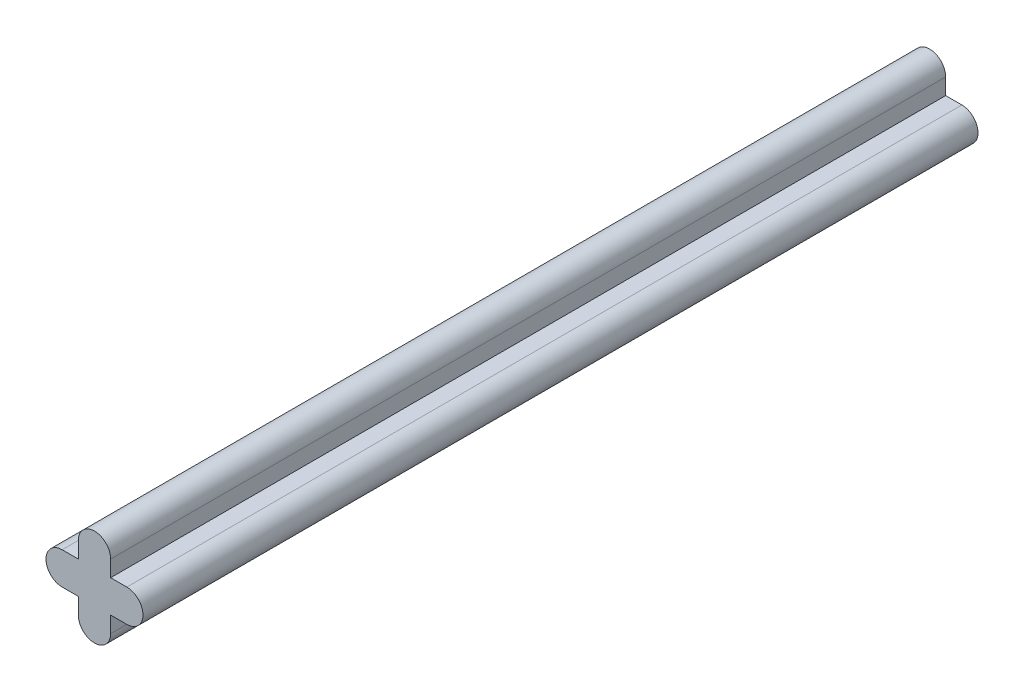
ISO-10303-21;
HEADER;
FILE_DESCRIPTION(('STEP AP214'),'2;1');
FILE_NAME('part.step','',(''),(''),'','','');
FILE_SCHEMA(('AUTOMOTIVE_DESIGN { 1 0 10303 214 1 1 1 1 }'));
ENDSEC;
DATA;
#1=APPLICATION_CONTEXT('core data for automotive mechanical design processes');
#2=APPLICATION_PROTOCOL_DEFINITION('international standard','automotive_design',2000,#1);
#3=PRODUCT_CONTEXT('',#1,'mechanical');
#4=PRODUCT('Part','Part','',(#3));
#5=PRODUCT_RELATED_PRODUCT_CATEGORY('part','',(#4));
#6=PRODUCT_DEFINITION_FORMATION('','',#4);
#7=PRODUCT_DEFINITION_CONTEXT('part definition',#1,'design');
#8=PRODUCT_DEFINITION('design','',#6,#7);
#9=PRODUCT_DEFINITION_SHAPE('','',#8);
#10=(LENGTH_UNIT() NAMED_UNIT(*) SI_UNIT(.MILLI.,.METRE.));
#11=(NAMED_UNIT(*) PLANE_ANGLE_UNIT() SI_UNIT($,.RADIAN.));
#12=(NAMED_UNIT(*) SI_UNIT($,.STERADIAN.) SOLID_ANGLE_UNIT());
#13=UNCERTAINTY_MEASURE_WITH_UNIT(LENGTH_MEASURE(1.E-05),#10,'distance_accuracy_value','');
#14=(GEOMETRIC_REPRESENTATION_CONTEXT(3) GLOBAL_UNCERTAINTY_ASSIGNED_CONTEXT((#13)) GLOBAL_UNIT_ASSIGNED_CONTEXT((#10,
#11,#12)) REPRESENTATION_CONTEXT('',''));
#15=CARTESIAN_POINT('',(0.,0.,0.));
#16=DIRECTION('',(0.,0.,1.));
#17=DIRECTION('',(1.,0.,0.));
#18=AXIS2_PLACEMENT_3D('',#15,#16,#17);
#19=CARTESIAN_POINT('',(1.524,0.762,39.37));
#20=DIRECTION('',(0.,1.,0.));
#21=DIRECTION('',(0.,0.,1.));
#22=AXIS2_PLACEMENT_3D('',#19,#20,#21);
#23=PLANE('',#22);
#24=DIRECTION('',(1.,0.,0.));
#25=VECTOR('',#24,1.);
#26=CARTESIAN_POINT('',(1.524,0.762,0.));
#27=LINE('',#26,#25);
#28=CARTESIAN_POINT('',(0.,0.762,0.));
#29=VERTEX_POINT('',#28);
#30=CARTESIAN_POINT('',(0.762000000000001,0.762,0.));
#31=VERTEX_POINT('',#30);
#32=EDGE_CURVE('E152',#29,#31,#27,.T.);
#33=ORIENTED_EDGE('',*,*,#32,.F.);
#34=DIRECTION('',(0.,0.,-1.));
#35=VECTOR('',#34,1.);
#36=CARTESIAN_POINT('',(0.,0.762,39.37));
#37=LINE('',#36,#35);
#38=CARTESIAN_POINT('',(0.,0.762,39.37));
#39=VERTEX_POINT('',#38);
#40=EDGE_CURVE('E11',#39,#29,#37,.T.);
#41=ORIENTED_EDGE('',*,*,#40,.F.);
#42=DIRECTION('',(1.,0.,0.));
#43=VECTOR('',#42,1.);
#44=CARTESIAN_POINT('',(1.524,0.762,39.37));
#45=LINE('',#44,#43);
#46=CARTESIAN_POINT('',(0.762000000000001,0.762,39.37));
#47=VERTEX_POINT('',#46);
#48=EDGE_CURVE('E179',#39,#47,#45,.T.);
#49=ORIENTED_EDGE('',*,*,#48,.T.);
#50=DIRECTION('',(0.,0.,-1.));
#51=VECTOR('',#50,1.);
#52=CARTESIAN_POINT('',(0.762000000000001,0.762,39.37));
#53=LINE('',#52,#51);
#54=EDGE_CURVE('E96',#47,#31,#53,.T.);
#55=ORIENTED_EDGE('',*,*,#54,.T.);
#56=EDGE_LOOP('',(#33,#41,#49,#55));
#57=FACE_BOUND('',#56,.T.);
#58=ADVANCED_FACE('F34',(#57),#23,.T.);
#59=CARTESIAN_POINT('',(0.,0.,39.37));
#60=DIRECTION('',(0.,0.,-1.));
#61=DIRECTION('',(-1.,0.,0.));
#62=AXIS2_PLACEMENT_3D('',#59,#60,#61);
#63=CYLINDRICAL_SURFACE('',#62,0.762);
#64=CARTESIAN_POINT('',(0.,0.,0.));
#65=DIRECTION('',(0.,0.,1.));
#66=DIRECTION('',(1.,0.,0.));
#67=AXIS2_PLACEMENT_3D('',#64,#65,#66);
#68=CIRCLE('',#67,0.762);
#69=CARTESIAN_POINT('',(0.,-0.762,0.));
#70=VERTEX_POINT('',#69);
#71=EDGE_CURVE('E155',#29,#70,#68,.T.);
#72=ORIENTED_EDGE('',*,*,#71,.T.);
#73=DIRECTION('',(0.,0.,-1.));
#74=VECTOR('',#73,1.);
#75=CARTESIAN_POINT('',(0.,-0.762,39.37));
#76=LINE('',#75,#74);
#77=CARTESIAN_POINT('',(0.,-0.762,39.37));
#78=VERTEX_POINT('',#77);
#79=EDGE_CURVE('E42',#78,#70,#76,.T.);
#80=ORIENTED_EDGE('',*,*,#79,.F.);
#81=CARTESIAN_POINT('',(0.,0.,39.37));
#82=DIRECTION('',(0.,0.,1.));
#83=DIRECTION('',(1.,0.,0.));
#84=AXIS2_PLACEMENT_3D('',#81,#82,#83);
#85=CIRCLE('',#84,0.762);
#86=EDGE_CURVE('E243',#39,#78,#85,.T.);
#87=ORIENTED_EDGE('',*,*,#86,.F.);
#88=ORIENTED_EDGE('',*,*,#40,.T.);
#89=EDGE_LOOP('',(#72,#80,#87,#88));
#90=FACE_BOUND('',#89,.T.);
#91=ADVANCED_FACE('F246',(#90),#63,.T.);
#92=CARTESIAN_POINT('',(1.524,-0.762,39.37));
#93=DIRECTION('',(0.,1.,0.));
#94=DIRECTION('',(0.,0.,1.));
#95=AXIS2_PLACEMENT_3D('',#92,#93,#94);
#96=PLANE('',#95);
#97=DIRECTION('',(1.,0.,0.));
#98=VECTOR('',#97,1.);
#99=CARTESIAN_POINT('',(1.524,-0.762,0.));
#100=LINE('',#99,#98);
#101=CARTESIAN_POINT('',(0.762000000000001,-0.762,0.));
#102=VERTEX_POINT('',#101);
#103=EDGE_CURVE('E157',#70,#102,#100,.T.);
#104=ORIENTED_EDGE('',*,*,#103,.T.);
#105=DIRECTION('',(0.,0.,-1.));
#106=VECTOR('',#105,1.);
#107=CARTESIAN_POINT('',(0.762000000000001,-0.762,39.37));
#108=LINE('',#107,#106);
#109=CARTESIAN_POINT('',(0.762000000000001,-0.762,39.37));
#110=VERTEX_POINT('',#109);
#111=EDGE_CURVE('E195',#110,#102,#108,.T.);
#112=ORIENTED_EDGE('',*,*,#111,.F.);
#113=DIRECTION('',(1.,0.,0.));
#114=VECTOR('',#113,1.);
#115=CARTESIAN_POINT('',(1.524,-0.762,39.37));
#116=LINE('',#115,#114);
#117=EDGE_CURVE('E204',#78,#110,#116,.T.);
#118=ORIENTED_EDGE('',*,*,#117,.F.);
#119=ORIENTED_EDGE('',*,*,#79,.T.);
#120=EDGE_LOOP('',(#104,#112,#118,#119));
#121=FACE_BOUND('',#120,.T.);
#122=ADVANCED_FACE('F202',(#121),#96,.F.);
#123=CARTESIAN_POINT('',(0.762000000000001,-4.4302164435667,39.37));
#124=DIRECTION('',(1.,0.,0.));
#125=DIRECTION('',(0.,0.,-1.));
#126=AXIS2_PLACEMENT_3D('',#123,#124,#125);
#127=PLANE('',#126);
#128=DIRECTION('',(0.,-1.,0.));
#129=VECTOR('',#128,1.);
#130=CARTESIAN_POINT('',(0.762000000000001,-4.4302164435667,0.));
#131=LINE('',#130,#129);
#132=CARTESIAN_POINT('',(0.762000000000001,-1.524,0.));
#133=VERTEX_POINT('',#132);
#134=EDGE_CURVE('E159',#102,#133,#131,.T.);
#135=ORIENTED_EDGE('',*,*,#134,.T.);
#136=DIRECTION('',(0.,0.,-1.));
#137=VECTOR('',#136,1.);
#138=CARTESIAN_POINT('',(0.762000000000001,-1.524,39.37));
#139=LINE('',#138,#137);
#140=CARTESIAN_POINT('',(0.762000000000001,-1.524,39.37));
#141=VERTEX_POINT('',#140);
#142=EDGE_CURVE('E192',#141,#133,#139,.T.);
#143=ORIENTED_EDGE('',*,*,#142,.F.);
#144=DIRECTION('',(0.,-1.,0.));
#145=VECTOR('',#144,1.);
#146=CARTESIAN_POINT('',(0.762000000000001,-4.4302164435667,39.37));
#147=LINE('',#146,#145);
#148=EDGE_CURVE('E223',#110,#141,#147,.T.);
#149=ORIENTED_EDGE('',*,*,#148,.F.);
#150=ORIENTED_EDGE('',*,*,#111,.T.);
#151=EDGE_LOOP('',(#135,#143,#149,#150));
#152=FACE_BOUND('',#151,.T.);
#153=ADVANCED_FACE('F213',(#152),#127,.F.);
#154=CARTESIAN_POINT('',(1.524,-1.524,39.37));
#155=DIRECTION('',(0.,0.,-1.));
#156=DIRECTION('',(-1.,0.,0.));
#157=AXIS2_PLACEMENT_3D('',#154,#155,#156);
#158=CYLINDRICAL_SURFACE('',#157,0.761999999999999);
#159=CARTESIAN_POINT('',(1.524,-1.524,0.));
#160=DIRECTION('',(0.,0.,1.));
#161=DIRECTION('',(1.,0.,0.));
#162=AXIS2_PLACEMENT_3D('',#159,#160,#161);
#163=CIRCLE('',#162,0.761999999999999);
#164=CARTESIAN_POINT('',(2.286,-1.524,0.));
#165=VERTEX_POINT('',#164);
#166=EDGE_CURVE('E161',#133,#165,#163,.T.);
#167=ORIENTED_EDGE('',*,*,#166,.T.);
#168=DIRECTION('',(0.,0.,-1.));
#169=VECTOR('',#168,1.);
#170=CARTESIAN_POINT('',(2.286,-1.524,39.37));
#171=LINE('',#170,#169);
#172=CARTESIAN_POINT('',(2.286,-1.524,39.37));
#173=VERTEX_POINT('',#172);
#174=EDGE_CURVE('E190',#173,#165,#171,.T.);
#175=ORIENTED_EDGE('',*,*,#174,.F.);
#176=CARTESIAN_POINT('',(1.524,-1.524,39.37));
#177=DIRECTION('',(0.,0.,1.));
#178=DIRECTION('',(1.,0.,0.));
#179=AXIS2_PLACEMENT_3D('',#176,#177,#178);
#180=CIRCLE('',#179,0.761999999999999);
#181=EDGE_CURVE('E219',#141,#173,#180,.T.);
#182=ORIENTED_EDGE('',*,*,#181,.F.);
#183=ORIENTED_EDGE('',*,*,#142,.T.);
#184=EDGE_LOOP('',(#167,#175,#182,#183));
#185=FACE_BOUND('',#184,.T.);
#186=ADVANCED_FACE('F217',(#185),#158,.T.);
#187=CARTESIAN_POINT('',(2.286,-4.4302164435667,39.37));
#188=DIRECTION('',(1.,0.,0.));
#189=DIRECTION('',(0.,0.,-1.));
#190=AXIS2_PLACEMENT_3D('',#187,#188,#189);
#191=PLANE('',#190);
#192=DIRECTION('',(0.,-1.,0.));
#193=VECTOR('',#192,1.);
#194=CARTESIAN_POINT('',(2.286,-4.4302164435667,0.));
#195=LINE('',#194,#193);
#196=CARTESIAN_POINT('',(2.286,-0.762,0.));
#197=VERTEX_POINT('',#196);
#198=EDGE_CURVE('E164',#197,#165,#195,.T.);
#199=ORIENTED_EDGE('',*,*,#198,.F.);
#200=DIRECTION('',(0.,0.,-1.));
#201=VECTOR('',#200,1.);
#202=CARTESIAN_POINT('',(2.286,-0.762,39.37));
#203=LINE('',#202,#201);
#204=CARTESIAN_POINT('',(2.286,-0.762,39.37));
#205=VERTEX_POINT('',#204);
#206=EDGE_CURVE('E188',#205,#197,#203,.T.);
#207=ORIENTED_EDGE('',*,*,#206,.F.);
#208=DIRECTION('',(0.,-1.,0.));
#209=VECTOR('',#208,1.);
#210=CARTESIAN_POINT('',(2.286,-4.4302164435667,39.37));
#211=LINE('',#210,#209);
#212=EDGE_CURVE('E222',#205,#173,#211,.T.);
#213=ORIENTED_EDGE('',*,*,#212,.T.);
#214=ORIENTED_EDGE('',*,*,#174,.T.);
#215=EDGE_LOOP('',(#199,#207,#213,#214));
#216=FACE_BOUND('',#215,.T.);
#217=ADVANCED_FACE('F258',(#216),#191,.T.);
#218=CARTESIAN_POINT('',(1.524,-0.762,39.37));
#219=DIRECTION('',(0.,1.,0.));
#220=DIRECTION('',(0.,0.,1.));
#221=AXIS2_PLACEMENT_3D('',#218,#219,#220);
#222=PLANE('',#221);
#223=DIRECTION('',(1.,0.,0.));
#224=VECTOR('',#223,1.);
#225=CARTESIAN_POINT('',(1.524,-0.762,0.));
#226=LINE('',#225,#224);
#227=CARTESIAN_POINT('',(3.048,-0.762,0.));
#228=VERTEX_POINT('',#227);
#229=EDGE_CURVE('E167',#197,#228,#226,.T.);
#230=ORIENTED_EDGE('',*,*,#229,.T.);
#231=DIRECTION('',(0.,0.,-1.));
#232=VECTOR('',#231,1.);
#233=CARTESIAN_POINT('',(3.048,-0.762,39.37));
#234=LINE('',#233,#232);
#235=CARTESIAN_POINT('',(3.048,-0.762,39.37));
#236=VERTEX_POINT('',#235);
#237=EDGE_CURVE('E185',#236,#228,#234,.T.);
#238=ORIENTED_EDGE('',*,*,#237,.F.);
#239=DIRECTION('',(1.,0.,0.));
#240=VECTOR('',#239,1.);
#241=CARTESIAN_POINT('',(1.524,-0.762,39.37));
#242=LINE('',#241,#240);
#243=EDGE_CURVE('E225',#205,#236,#242,.T.);
#244=ORIENTED_EDGE('',*,*,#243,.F.);
#245=ORIENTED_EDGE('',*,*,#206,.T.);
#246=EDGE_LOOP('',(#230,#238,#244,#245));
#247=FACE_BOUND('',#246,.T.);
#248=ADVANCED_FACE('F261',(#247),#222,.F.);
#249=CARTESIAN_POINT('',(3.048,0.,39.37));
#250=DIRECTION('',(0.,0.,-1.));
#251=DIRECTION('',(-1.,0.,0.));
#252=AXIS2_PLACEMENT_3D('',#249,#250,#251);
#253=CYLINDRICAL_SURFACE('',#252,0.762);
#254=CARTESIAN_POINT('',(3.048,0.,0.));
#255=DIRECTION('',(0.,0.,1.));
#256=DIRECTION('',(1.,0.,0.));
#257=AXIS2_PLACEMENT_3D('',#254,#255,#256);
#258=CIRCLE('',#257,0.762);
#259=CARTESIAN_POINT('',(3.048,0.762,0.));
#260=VERTEX_POINT('',#259);
#261=EDGE_CURVE('E169',#228,#260,#258,.T.);
#262=ORIENTED_EDGE('',*,*,#261,.T.);
#263=DIRECTION('',(0.,0.,-1.));
#264=VECTOR('',#263,1.);
#265=CARTESIAN_POINT('',(3.048,0.762,39.37));
#266=LINE('',#265,#264);
#267=CARTESIAN_POINT('',(3.048,0.762,39.37));
#268=VERTEX_POINT('',#267);
#269=EDGE_CURVE('E183',#268,#260,#266,.T.);
#270=ORIENTED_EDGE('',*,*,#269,.F.);
#271=CARTESIAN_POINT('',(3.048,0.,39.37));
#272=DIRECTION('',(0.,0.,1.));
#273=DIRECTION('',(1.,0.,0.));
#274=AXIS2_PLACEMENT_3D('',#271,#272,#273);
#275=CIRCLE('',#274,0.762);
#276=EDGE_CURVE('E147',#236,#268,#275,.T.);
#277=ORIENTED_EDGE('',*,*,#276,.F.);
#278=ORIENTED_EDGE('',*,*,#237,.T.);
#279=EDGE_LOOP('',(#262,#270,#277,#278));
#280=FACE_BOUND('',#279,.T.);
#281=ADVANCED_FACE('F235',(#280),#253,.T.);
#282=CARTESIAN_POINT('',(1.524,0.762,39.37));
#283=DIRECTION('',(0.,1.,0.));
#284=DIRECTION('',(0.,0.,1.));
#285=AXIS2_PLACEMENT_3D('',#282,#283,#284);
#286=PLANE('',#285);
#287=DIRECTION('',(1.,0.,0.));
#288=VECTOR('',#287,1.);
#289=CARTESIAN_POINT('',(1.524,0.762,0.));
#290=LINE('',#289,#288);
#291=CARTESIAN_POINT('',(2.286,0.762,0.));
#292=VERTEX_POINT('',#291);
#293=EDGE_CURVE('E172',#292,#260,#290,.T.);
#294=ORIENTED_EDGE('',*,*,#293,.F.);
#295=DIRECTION('',(0.,0.,-1.));
#296=VECTOR('',#295,1.);
#297=CARTESIAN_POINT('',(2.286,0.762,39.37));
#298=LINE('',#297,#296);
#299=CARTESIAN_POINT('',(2.286,0.762,39.37));
#300=VERTEX_POINT('',#299);
#301=EDGE_CURVE('E136',#300,#292,#298,.T.);
#302=ORIENTED_EDGE('',*,*,#301,.F.);
#303=DIRECTION('',(1.,0.,0.));
#304=VECTOR('',#303,1.);
#305=CARTESIAN_POINT('',(1.524,0.762,39.37));
#306=LINE('',#305,#304);
#307=EDGE_CURVE('E145',#300,#268,#306,.T.);
#308=ORIENTED_EDGE('',*,*,#307,.T.);
#309=ORIENTED_EDGE('',*,*,#269,.T.);
#310=EDGE_LOOP('',(#294,#302,#308,#309));
#311=FACE_BOUND('',#310,.T.);
#312=ADVANCED_FACE('F239',(#311),#286,.T.);
#313=CARTESIAN_POINT('',(2.286,-4.4302164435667,39.37));
#314=DIRECTION('',(1.,0.,0.));
#315=DIRECTION('',(0.,0.,-1.));
#316=AXIS2_PLACEMENT_3D('',#313,#314,#315);
#317=PLANE('',#316);
#318=DIRECTION('',(0.,-1.,0.));
#319=VECTOR('',#318,1.);
#320=CARTESIAN_POINT('',(2.286,-4.4302164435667,0.));
#321=LINE('',#320,#319);
#322=CARTESIAN_POINT('',(2.286,1.524,0.));
#323=VERTEX_POINT('',#322);
#324=EDGE_CURVE('E135',#323,#292,#321,.T.);
#325=ORIENTED_EDGE('',*,*,#324,.F.);
#326=DIRECTION('',(0.,0.,-1.));
#327=VECTOR('',#326,1.);
#328=CARTESIAN_POINT('',(2.286,1.524,39.37));
#329=LINE('',#328,#327);
#330=CARTESIAN_POINT('',(2.286,1.524,39.37));
#331=VERTEX_POINT('',#330);
#332=EDGE_CURVE('E129',#331,#323,#329,.T.);
#333=ORIENTED_EDGE('',*,*,#332,.F.);
#334=DIRECTION('',(0.,-1.,0.));
#335=VECTOR('',#334,1.);
#336=CARTESIAN_POINT('',(2.286,-4.4302164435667,39.37));
#337=LINE('',#336,#335);
#338=EDGE_CURVE('E133',#331,#300,#337,.T.);
#339=ORIENTED_EDGE('',*,*,#338,.T.);
#340=ORIENTED_EDGE('',*,*,#301,.T.);
#341=EDGE_LOOP('',(#325,#333,#339,#340));
#342=FACE_BOUND('',#341,.T.);
#343=ADVANCED_FACE('F131',(#342),#317,.T.);
#344=CARTESIAN_POINT('',(1.524,1.524,39.37));
#345=DIRECTION('',(0.,0.,-1.));
#346=DIRECTION('',(-1.,0.,0.));
#347=AXIS2_PLACEMENT_3D('',#344,#345,#346);
#348=CYLINDRICAL_SURFACE('',#347,0.761999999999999);
#349=CARTESIAN_POINT('',(1.524,1.524,0.));
#350=DIRECTION('',(0.,0.,1.));
#351=DIRECTION('',(1.,0.,0.));
#352=AXIS2_PLACEMENT_3D('',#349,#350,#351);
#353=CIRCLE('',#352,0.761999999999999);
#354=CARTESIAN_POINT('',(0.762000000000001,1.524,0.));
#355=VERTEX_POINT('',#354);
#356=EDGE_CURVE('E89',#323,#355,#353,.T.);
#357=ORIENTED_EDGE('',*,*,#356,.T.);
#358=DIRECTION('',(0.,0.,-1.));
#359=VECTOR('',#358,1.);
#360=CARTESIAN_POINT('',(0.762000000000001,1.524,39.37));
#361=LINE('',#360,#359);
#362=CARTESIAN_POINT('',(0.762000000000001,1.524,39.37));
#363=VERTEX_POINT('',#362);
#364=EDGE_CURVE('E137',#363,#355,#361,.T.);
#365=ORIENTED_EDGE('',*,*,#364,.F.);
#366=CARTESIAN_POINT('',(1.524,1.524,39.37));
#367=DIRECTION('',(0.,0.,1.));
#368=DIRECTION('',(1.,0.,0.));
#369=AXIS2_PLACEMENT_3D('',#366,#367,#368);
#370=CIRCLE('',#369,0.761999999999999);
#371=EDGE_CURVE('E139',#331,#363,#370,.T.);
#372=ORIENTED_EDGE('',*,*,#371,.F.);
#373=ORIENTED_EDGE('',*,*,#332,.T.);
#374=EDGE_LOOP('',(#357,#365,#372,#373));
#375=FACE_BOUND('',#374,.T.);
#376=ADVANCED_FACE('F140',(#375),#348,.T.);
#377=CARTESIAN_POINT('',(0.762000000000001,-4.4302164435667,39.37));
#378=DIRECTION('',(1.,0.,0.));
#379=DIRECTION('',(0.,0.,-1.));
#380=AXIS2_PLACEMENT_3D('',#377,#378,#379);
#381=PLANE('',#380);
#382=DIRECTION('',(0.,-1.,0.));
#383=VECTOR('',#382,1.);
#384=CARTESIAN_POINT('',(0.762000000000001,-4.4302164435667,0.));
#385=LINE('',#384,#383);
#386=EDGE_CURVE('E177',#355,#31,#385,.T.);
#387=ORIENTED_EDGE('',*,*,#386,.T.);
#388=ORIENTED_EDGE('',*,*,#54,.F.);
#389=DIRECTION('',(0.,-1.,0.));
#390=VECTOR('',#389,1.);
#391=CARTESIAN_POINT('',(0.762000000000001,-4.4302164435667,39.37));
#392=LINE('',#391,#390);
#393=EDGE_CURVE('E50',#363,#47,#392,.T.);
#394=ORIENTED_EDGE('',*,*,#393,.F.);
#395=ORIENTED_EDGE('',*,*,#364,.T.);
#396=EDGE_LOOP('',(#387,#388,#394,#395));
#397=FACE_BOUND('',#396,.T.);
#398=ADVANCED_FACE('F242',(#397),#381,.F.);
#399=CARTESIAN_POINT('',(1.524,-4.4302164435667,39.37));
#400=DIRECTION('',(0.,0.,1.));
#401=DIRECTION('',(1.,0.,0.));
#402=AXIS2_PLACEMENT_3D('',#399,#400,#401);
#403=PLANE('',#402);
#404=ORIENTED_EDGE('',*,*,#48,.F.);
#405=ORIENTED_EDGE('',*,*,#86,.T.);
#406=ORIENTED_EDGE('',*,*,#117,.T.);
#407=ORIENTED_EDGE('',*,*,#148,.T.);
#408=ORIENTED_EDGE('',*,*,#181,.T.);
#409=ORIENTED_EDGE('',*,*,#212,.F.);
#410=ORIENTED_EDGE('',*,*,#243,.T.);
#411=ORIENTED_EDGE('',*,*,#276,.T.);
#412=ORIENTED_EDGE('',*,*,#307,.F.);
#413=ORIENTED_EDGE('',*,*,#338,.F.);
#414=ORIENTED_EDGE('',*,*,#371,.T.);
#415=ORIENTED_EDGE('',*,*,#393,.T.);
#416=EDGE_LOOP('',(#404,#405,#406,#407,#408,#409,#410,#411,#412,#413,#414,#415));
#417=FACE_BOUND('',#416,.T.);
#418=ADVANCED_FACE('F143',(#417),#403,.T.);
#419=CARTESIAN_POINT('',(1.524,-4.4302164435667,0.));
#420=DIRECTION('',(0.,0.,1.));
#421=DIRECTION('',(1.,0.,0.));
#422=AXIS2_PLACEMENT_3D('',#419,#420,#421);
#423=PLANE('',#422);
#424=ORIENTED_EDGE('',*,*,#32,.T.);
#425=ORIENTED_EDGE('',*,*,#386,.F.);
#426=ORIENTED_EDGE('',*,*,#356,.F.);
#427=ORIENTED_EDGE('',*,*,#324,.T.);
#428=ORIENTED_EDGE('',*,*,#293,.T.);
#429=ORIENTED_EDGE('',*,*,#261,.F.);
#430=ORIENTED_EDGE('',*,*,#229,.F.);
#431=ORIENTED_EDGE('',*,*,#198,.T.);
#432=ORIENTED_EDGE('',*,*,#166,.F.);
#433=ORIENTED_EDGE('',*,*,#134,.F.);
#434=ORIENTED_EDGE('',*,*,#103,.F.);
#435=ORIENTED_EDGE('',*,*,#71,.F.);
#436=EDGE_LOOP('',(#424,#425,#426,#427,#428,#429,#430,#431,#432,#433,#434,#435));
#437=FACE_BOUND('',#436,.T.);
#438=ADVANCED_FACE('F209',(#437),#423,.F.);
#439=CLOSED_SHELL('',(#58,#91,#122,#153,#186,#217,#248,#281,#312,#343,#376,#398,#418,#438));
#440=MANIFOLD_SOLID_BREP('B2',#439);
#441=ADVANCED_BREP_SHAPE_REPRESENTATION('',(#18,#440),#14);
#442=SHAPE_DEFINITION_REPRESENTATION(#9,#441);
ENDSEC;
END-ISO-10303-21;
